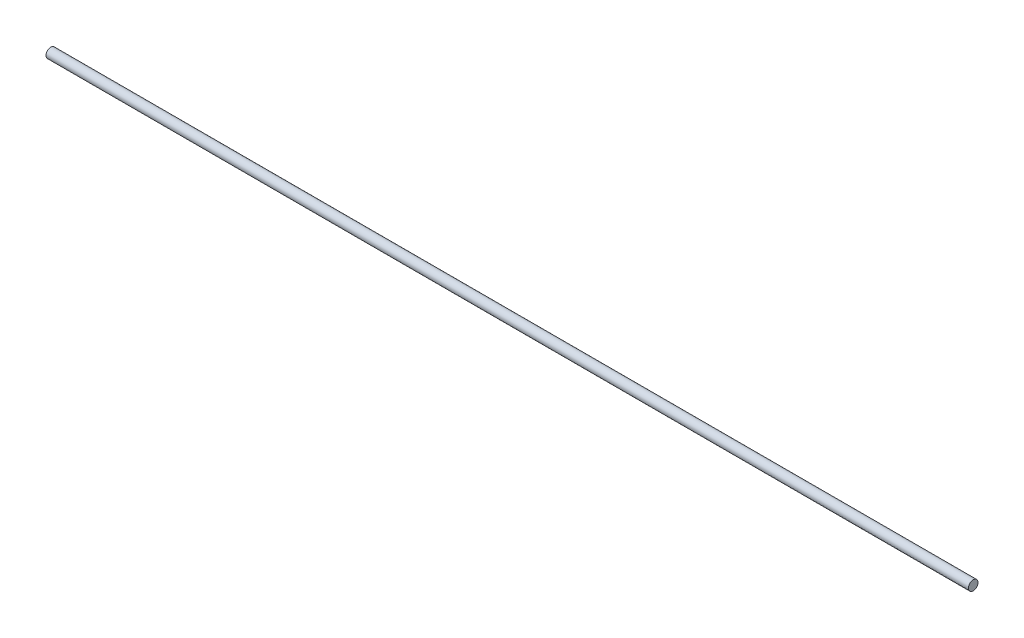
from build123d import *

# Parameters (mm, degrees)
SKETCH2_R           = 6.35
BOSS_EXTRUDE1_DEPTH = 1219.2


with BuildPart() as part:
    # Sketch2 → Boss-Extrude1 (new body)
    with BuildSketch(Plane(origin=(0, 0, 0), x_dir=(0, 0, -1), z_dir=(1, 0, 0))):
        with Locations(Location((0, 0, 0), (0, 0, 180))):
            Circle(SKETCH2_R)
    extrude(amount=BOSS_EXTRUDE1_DEPTH)


solid = part.part
